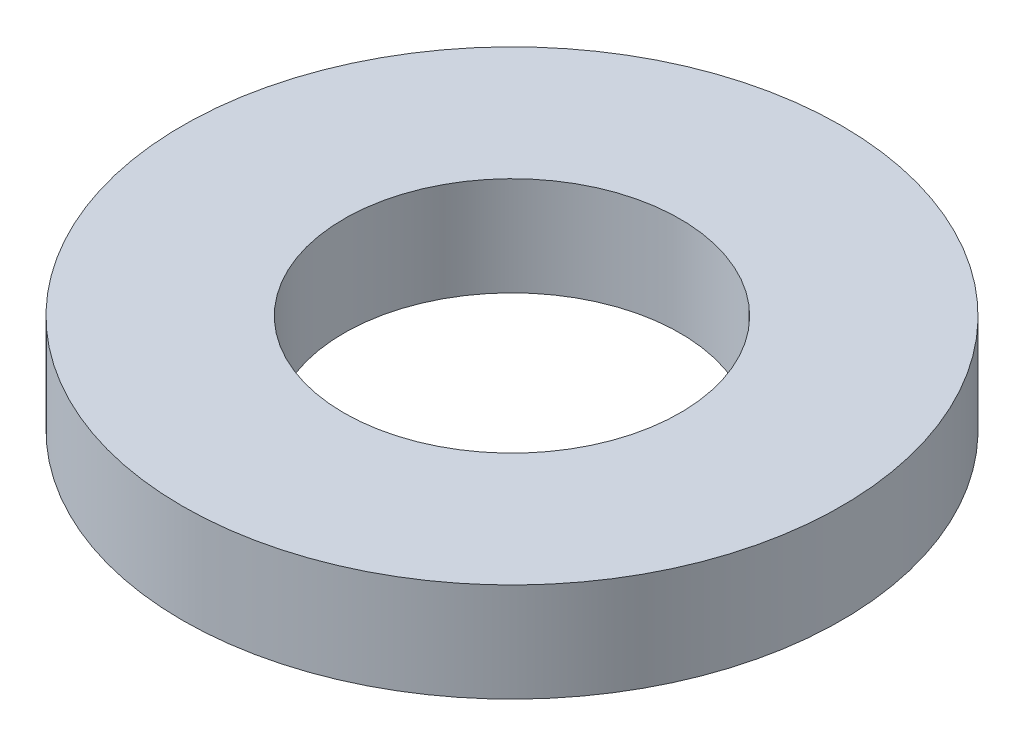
ISO-10303-21;
HEADER;
FILE_DESCRIPTION(('STEP AP214'),'2;1');
FILE_NAME('part.step','',(''),(''),'','','');
FILE_SCHEMA(('AUTOMOTIVE_DESIGN { 1 0 10303 214 1 1 1 1 }'));
ENDSEC;
DATA;
#1=APPLICATION_CONTEXT('core data for automotive mechanical design processes');
#2=APPLICATION_PROTOCOL_DEFINITION('international standard','automotive_design',2000,#1);
#3=PRODUCT_CONTEXT('',#1,'mechanical');
#4=PRODUCT('Part','Part','',(#3));
#5=PRODUCT_RELATED_PRODUCT_CATEGORY('part','',(#4));
#6=PRODUCT_DEFINITION_FORMATION('','',#4);
#7=PRODUCT_DEFINITION_CONTEXT('part definition',#1,'design');
#8=PRODUCT_DEFINITION('design','',#6,#7);
#9=PRODUCT_DEFINITION_SHAPE('','',#8);
#10=(LENGTH_UNIT() NAMED_UNIT(*) SI_UNIT(.MILLI.,.METRE.));
#11=(NAMED_UNIT(*) PLANE_ANGLE_UNIT() SI_UNIT($,.RADIAN.));
#12=(NAMED_UNIT(*) SI_UNIT($,.STERADIAN.) SOLID_ANGLE_UNIT());
#13=UNCERTAINTY_MEASURE_WITH_UNIT(LENGTH_MEASURE(1.E-05),#10,'distance_accuracy_value','');
#14=(GEOMETRIC_REPRESENTATION_CONTEXT(3) GLOBAL_UNCERTAINTY_ASSIGNED_CONTEXT((#13)) GLOBAL_UNIT_ASSIGNED_CONTEXT((#10,
#11,#12)) REPRESENTATION_CONTEXT('',''));
#15=CARTESIAN_POINT('',(0.,0.,0.));
#16=DIRECTION('',(0.,0.,1.));
#17=DIRECTION('',(1.,0.,0.));
#18=AXIS2_PLACEMENT_3D('',#15,#16,#17);
#19=CARTESIAN_POINT('',(0.,3.,0.));
#20=DIRECTION('',(0.,1.,0.));
#21=DIRECTION('',(0.,0.,1.));
#22=AXIS2_PLACEMENT_3D('',#19,#20,#21);
#23=PLANE('',#22);
#24=CARTESIAN_POINT('',(0.,3.,0.));
#25=DIRECTION('',(0.,1.,0.));
#26=DIRECTION('',(0.,0.,1.));
#27=AXIS2_PLACEMENT_3D('',#24,#25,#26);
#28=CIRCLE('',#27,10.);
#29=CARTESIAN_POINT('',(0.,3.,10.));
#30=VERTEX_POINT('',#29);
#31=EDGE_CURVE('E10',#30,#30,#28,.T.);
#32=ORIENTED_EDGE('',*,*,#31,.T.);
#33=EDGE_LOOP('',(#32));
#34=FACE_BOUND('',#33,.T.);
#35=CARTESIAN_POINT('',(0.,3.,0.));
#36=DIRECTION('',(0.,1.,0.));
#37=DIRECTION('',(0.,0.,1.));
#38=AXIS2_PLACEMENT_3D('',#35,#36,#37);
#39=CIRCLE('',#38,5.1);
#40=CARTESIAN_POINT('',(0.,3.,5.1));
#41=VERTEX_POINT('',#40);
#42=EDGE_CURVE('E57',#41,#41,#39,.T.);
#43=ORIENTED_EDGE('',*,*,#42,.F.);
#44=EDGE_LOOP('',(#43));
#45=FACE_BOUND('',#44,.T.);
#46=ADVANCED_FACE('F43',(#34,#45),#23,.T.);
#47=CARTESIAN_POINT('',(0.,0.,0.));
#48=DIRECTION('',(0.,1.,0.));
#49=DIRECTION('',(0.,0.,1.));
#50=AXIS2_PLACEMENT_3D('',#47,#48,#49);
#51=PLANE('',#50);
#52=CARTESIAN_POINT('',(0.,0.,0.));
#53=DIRECTION('',(0.,1.,0.));
#54=DIRECTION('',(0.,0.,1.));
#55=AXIS2_PLACEMENT_3D('',#52,#53,#54);
#56=CIRCLE('',#55,10.);
#57=CARTESIAN_POINT('',(0.,0.,10.));
#58=VERTEX_POINT('',#57);
#59=EDGE_CURVE('E50',#58,#58,#56,.T.);
#60=ORIENTED_EDGE('',*,*,#59,.F.);
#61=EDGE_LOOP('',(#60));
#62=FACE_BOUND('',#61,.T.);
#63=CARTESIAN_POINT('',(0.,0.,0.));
#64=DIRECTION('',(0.,1.,0.));
#65=DIRECTION('',(0.,0.,1.));
#66=AXIS2_PLACEMENT_3D('',#63,#64,#65);
#67=CIRCLE('',#66,5.1);
#68=CARTESIAN_POINT('',(0.,0.,5.1));
#69=VERTEX_POINT('',#68);
#70=EDGE_CURVE('E59',#69,#69,#67,.T.);
#71=ORIENTED_EDGE('',*,*,#70,.T.);
#72=EDGE_LOOP('',(#71));
#73=FACE_BOUND('',#72,.T.);
#74=ADVANCED_FACE('F67',(#62,#73),#51,.F.);
#75=CARTESIAN_POINT('',(0.,3.,0.));
#76=DIRECTION('',(0.,-1.,0.));
#77=DIRECTION('',(0.,0.,-1.));
#78=AXIS2_PLACEMENT_3D('',#75,#76,#77);
#79=CYLINDRICAL_SURFACE('',#78,10.);
#80=ORIENTED_EDGE('',*,*,#31,.F.);
#81=EDGE_LOOP('',(#80));
#82=FACE_BOUND('',#81,.T.);
#83=ORIENTED_EDGE('',*,*,#59,.T.);
#84=EDGE_LOOP('',(#83));
#85=FACE_BOUND('',#84,.T.);
#86=ADVANCED_FACE('F44',(#82,#85),#79,.T.);
#87=CARTESIAN_POINT('',(0.,3.,0.));
#88=DIRECTION('',(0.,-1.,0.));
#89=DIRECTION('',(0.,0.,-1.));
#90=AXIS2_PLACEMENT_3D('',#87,#88,#89);
#91=CYLINDRICAL_SURFACE('',#90,5.1);
#92=ORIENTED_EDGE('',*,*,#42,.T.);
#93=EDGE_LOOP('',(#92));
#94=FACE_BOUND('',#93,.T.);
#95=ORIENTED_EDGE('',*,*,#70,.F.);
#96=EDGE_LOOP('',(#95));
#97=FACE_BOUND('',#96,.T.);
#98=ADVANCED_FACE('F69',(#94,#97),#91,.F.);
#99=CLOSED_SHELL('',(#46,#74,#86,#98));
#100=MANIFOLD_SOLID_BREP('B2',#99);
#101=ADVANCED_BREP_SHAPE_REPRESENTATION('',(#18,#100),#14);
#102=SHAPE_DEFINITION_REPRESENTATION(#9,#101);
ENDSEC;
END-ISO-10303-21;
